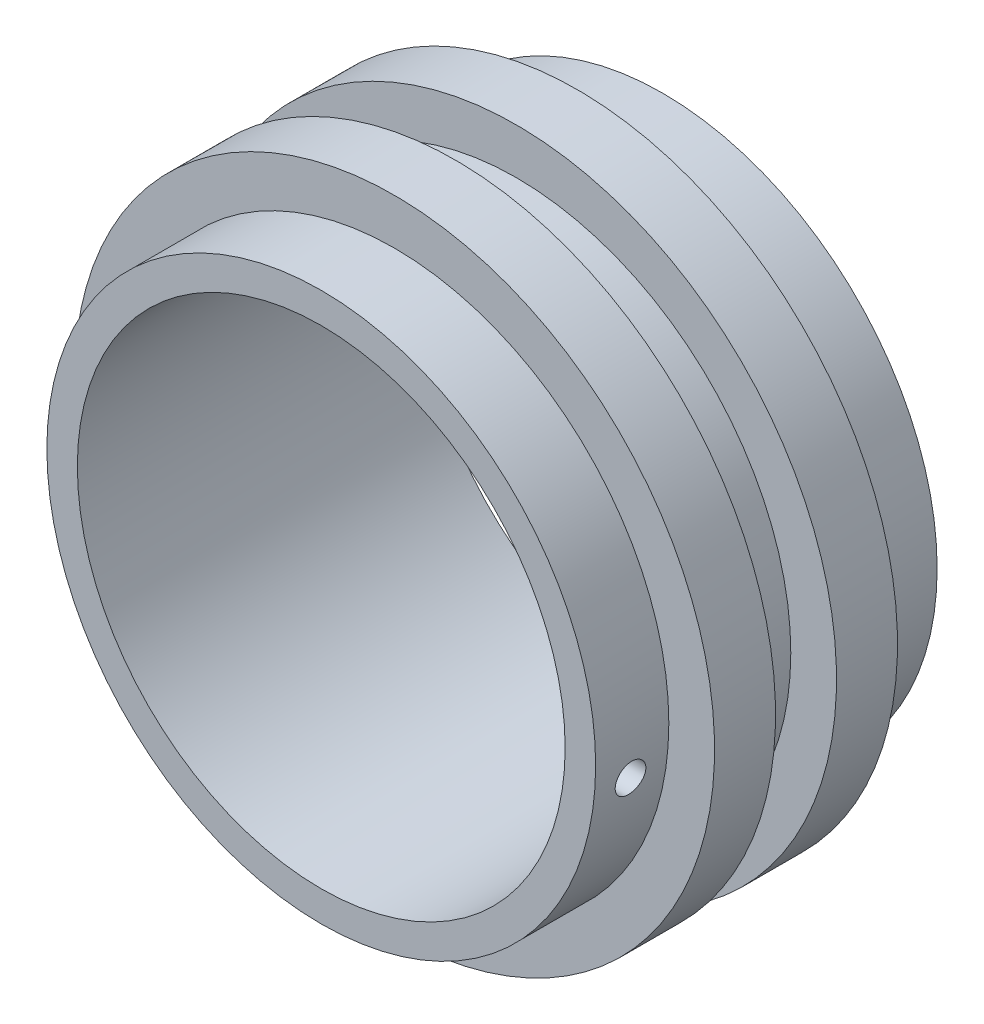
ISO-10303-21;
HEADER;
FILE_DESCRIPTION(('STEP AP214'),'2;1');
FILE_NAME('part.step','',(''),(''),'','','');
FILE_SCHEMA(('AUTOMOTIVE_DESIGN { 1 0 10303 214 1 1 1 1 }'));
ENDSEC;
DATA;
#1=APPLICATION_CONTEXT('core data for automotive mechanical design processes');
#2=APPLICATION_PROTOCOL_DEFINITION('international standard','automotive_design',2000,#1);
#3=PRODUCT_CONTEXT('',#1,'mechanical');
#4=PRODUCT('Part','Part','',(#3));
#5=PRODUCT_RELATED_PRODUCT_CATEGORY('part','',(#4));
#6=PRODUCT_DEFINITION_FORMATION('','',#4);
#7=PRODUCT_DEFINITION_CONTEXT('part definition',#1,'design');
#8=PRODUCT_DEFINITION('design','',#6,#7);
#9=PRODUCT_DEFINITION_SHAPE('','',#8);
#10=(LENGTH_UNIT() NAMED_UNIT(*) SI_UNIT(.MILLI.,.METRE.));
#11=(NAMED_UNIT(*) PLANE_ANGLE_UNIT() SI_UNIT($,.RADIAN.));
#12=(NAMED_UNIT(*) SI_UNIT($,.STERADIAN.) SOLID_ANGLE_UNIT());
#13=UNCERTAINTY_MEASURE_WITH_UNIT(LENGTH_MEASURE(1.E-05),#10,'distance_accuracy_value','');
#14=(GEOMETRIC_REPRESENTATION_CONTEXT(3) GLOBAL_UNCERTAINTY_ASSIGNED_CONTEXT((#13)) GLOBAL_UNIT_ASSIGNED_CONTEXT((#10,
#11,#12)) REPRESENTATION_CONTEXT('',''));
#15=CARTESIAN_POINT('',(0.,0.,0.));
#16=DIRECTION('',(0.,0.,1.));
#17=DIRECTION('',(1.,0.,0.));
#18=AXIS2_PLACEMENT_3D('',#15,#16,#17);
#19=CARTESIAN_POINT('',(0.,0.,152.4));
#20=DIRECTION('',(0.,0.,-1.));
#21=DIRECTION('',(-1.,0.,0.));
#22=AXIS2_PLACEMENT_3D('',#19,#20,#21);
#23=CYLINDRICAL_SURFACE('',#22,57.15);
#24=CARTESIAN_POINT('',(57.0682037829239,-3.05656948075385,36.8487640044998));
#25=CARTESIAN_POINT('',(57.0682041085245,-3.05657730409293,36.6706670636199));
#26=CARTESIAN_POINT('',(57.0674046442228,-3.07160482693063,36.4924446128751));
#27=CARTESIAN_POINT('',(57.0641575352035,-3.13133920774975,36.14091254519));
#28=CARTESIAN_POINT('',(57.0617079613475,-3.17608080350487,35.9676089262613));
#29=CARTESIAN_POINT('',(57.055024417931,-3.29395714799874,35.6310526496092));
#30=CARTESIAN_POINT('',(57.0507912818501,-3.36707863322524,35.4677953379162));
#31=CARTESIAN_POINT('',(57.0403469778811,-3.53959716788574,35.1559374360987));
#32=CARTESIAN_POINT('',(57.0341362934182,-3.63898779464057,35.0073332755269));
#33=CARTESIAN_POINT('',(57.0195217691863,-3.86121770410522,34.7289081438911));
#34=CARTESIAN_POINT('',(57.0111174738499,-3.98406185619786,34.5990910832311));
#35=CARTESIAN_POINT('',(56.9919347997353,-4.24965372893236,34.361932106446));
#36=CARTESIAN_POINT('',(56.9811563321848,-4.3924021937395,34.2545910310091));
#37=CARTESIAN_POINT('',(56.9571160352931,-4.693856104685,34.0652816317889));
#38=CARTESIAN_POINT('',(56.9438515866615,-4.85257829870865,33.9833403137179));
#39=CARTESIAN_POINT('',(56.9148820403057,-5.18130314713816,33.8472286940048));
#40=CARTESIAN_POINT('',(56.8991769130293,-5.35130593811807,33.7930587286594));
#41=CARTESIAN_POINT('',(56.8654706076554,-5.69835354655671,33.713784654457));
#42=CARTESIAN_POINT('',(56.8474617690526,-5.87542043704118,33.688780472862));
#43=CARTESIAN_POINT('',(56.809581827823,-6.23104233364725,33.6687726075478));
#44=CARTESIAN_POINT('',(56.7897106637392,-6.40959738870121,33.6737699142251));
#45=CARTESIAN_POINT('',(56.7485641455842,-6.76424618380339,33.7136550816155));
#46=CARTESIAN_POINT('',(56.7272812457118,-6.94031937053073,33.7487179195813));
#47=CARTESIAN_POINT('',(56.6841758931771,-7.28400450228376,33.8479308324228));
#48=CARTESIAN_POINT('',(56.6623534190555,-7.45161610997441,33.91208206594));
#49=CARTESIAN_POINT('',(56.6189581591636,-7.774494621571,34.0680612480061));
#50=CARTESIAN_POINT('',(56.5973871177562,-7.92969710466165,34.160023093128));
#51=CARTESIAN_POINT('',(56.5555993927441,-8.22244342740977,34.368968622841));
#52=CARTESIAN_POINT('',(56.5353827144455,-8.35998719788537,34.4859524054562));
#53=CARTESIAN_POINT('',(56.4973519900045,-8.61325306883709,34.7415100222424));
#54=CARTESIAN_POINT('',(56.4795342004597,-8.72900928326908,34.8800494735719));
#55=CARTESIAN_POINT('',(56.4472271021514,-8.93554793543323,35.1749865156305));
#56=CARTESIAN_POINT('',(56.432737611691,-9.02633173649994,35.3313831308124));
#57=CARTESIAN_POINT('',(56.4080387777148,-9.17941416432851,35.6559846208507));
#58=CARTESIAN_POINT('',(56.397789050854,-9.24198208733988,35.8240593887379));
#59=CARTESIAN_POINT('',(56.3819716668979,-9.33799564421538,36.1685394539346));
#60=CARTESIAN_POINT('',(56.3764036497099,-9.37144351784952,36.34494410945));
#61=CARTESIAN_POINT('',(56.3703218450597,-9.40795716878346,36.6988698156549));
#62=CARTESIAN_POINT('',(56.3697498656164,-9.41137275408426,36.8763538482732));
#63=CARTESIAN_POINT('',(56.3735416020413,-9.38863333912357,37.2293591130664));
#64=CARTESIAN_POINT('',(56.3779051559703,-9.36247930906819,37.4048804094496));
#65=CARTESIAN_POINT('',(56.3912813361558,-9.2815700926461,37.7482734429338));
#66=CARTESIAN_POINT('',(56.4002755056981,-9.22692844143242,37.9161726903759));
#67=CARTESIAN_POINT('',(56.4223844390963,-9.090751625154,38.2403893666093));
#68=CARTESIAN_POINT('',(56.4354993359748,-9.00921559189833,38.3967064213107));
#69=CARTESIAN_POINT('',(56.4652306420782,-8.82096024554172,38.6945535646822));
#70=CARTESIAN_POINT('',(56.4818712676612,-8.71406612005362,38.8359707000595));
#71=CARTESIAN_POINT('',(56.5177150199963,-8.47847583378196,39.0989205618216));
#72=CARTESIAN_POINT('',(56.5369183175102,-8.34977821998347,39.2204519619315));
#73=CARTESIAN_POINT('',(56.5771776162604,-8.07250246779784,39.4417211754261));
#74=CARTESIAN_POINT('',(56.5982531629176,-7.92370335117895,39.5411785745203));
#75=CARTESIAN_POINT('',(56.6410689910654,-7.61160862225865,39.7137096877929));
#76=CARTESIAN_POINT('',(56.6628093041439,-7.44831232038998,39.7867821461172));
#77=CARTESIAN_POINT('',(56.7062019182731,-7.11044091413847,39.9049849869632));
#78=CARTESIAN_POINT('',(56.7278522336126,-6.93578825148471,39.9498945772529));
#79=CARTESIAN_POINT('',(56.7700727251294,-6.58127615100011,40.0095613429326));
#80=CARTESIAN_POINT('',(56.7906428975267,-6.40141669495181,40.0243184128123));
#81=CARTESIAN_POINT('',(56.8300359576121,-6.04170737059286,40.0231780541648));
#82=CARTESIAN_POINT('',(56.848859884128,-5.86185756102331,40.0072989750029));
#83=CARTESIAN_POINT('',(56.8843095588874,-5.50723072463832,39.9452712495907));
#84=CARTESIAN_POINT('',(56.9009353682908,-5.33245355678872,39.8991234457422));
#85=CARTESIAN_POINT('',(56.9316345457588,-4.99401860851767,39.7781333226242));
#86=CARTESIAN_POINT('',(56.9457218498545,-4.83030340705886,39.7034551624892));
#87=CARTESIAN_POINT('',(56.9713764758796,-4.51767546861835,39.527451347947));
#88=CARTESIAN_POINT('',(56.9829439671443,-4.36876173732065,39.4261274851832));
#89=CARTESIAN_POINT('',(57.0035689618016,-4.09084052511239,39.2003146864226));
#90=CARTESIAN_POINT('',(57.0126398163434,-3.96172886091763,39.075955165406));
#91=CARTESIAN_POINT('',(57.02852165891,-3.72615052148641,38.8071905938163));
#92=CARTESIAN_POINT('',(57.0353321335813,-3.61968899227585,38.6627810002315));
#93=CARTESIAN_POINT('',(57.0468893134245,-3.43273964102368,38.3584067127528));
#94=CARTESIAN_POINT('',(57.0516404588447,-3.35219603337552,38.1984764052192));
#95=CARTESIAN_POINT('',(57.0593026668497,-3.21915535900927,37.8674559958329));
#96=CARTESIAN_POINT('',(57.0622158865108,-3.16662542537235,37.6963792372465));
#97=CARTESIAN_POINT('',(57.0656039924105,-3.10481524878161,37.4116702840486));
#98=CARTESIAN_POINT('',(57.0665808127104,-3.0867462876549,37.2998746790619));
#99=CARTESIAN_POINT('',(57.0678806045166,-3.06262091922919,37.0749909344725));
#100=CARTESIAN_POINT('',(57.0682035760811,-3.05656451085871,36.9619027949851));
#101=CARTESIAN_POINT('',(57.0682037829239,-3.05656948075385,36.8487640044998));
#102=B_SPLINE_CURVE_WITH_KNOTS('',3,(#24,#25,#26,#27,#28,#29,#30,#31,#32,#33,#34,#35,#36,#37,
#38,#39,#40,#41,#42,#43,#44,#45,#46,#47,#48,#49,#50,#51,#52,#53,#54,#55,#56,#57,#58,#59,#60,#61,
#62,#63,#64,#65,#66,#67,#68,#69,#70,#71,#72,#73,#74,#75,#76,#77,#78,#79,#80,#81,#82,#83,#84,#85,
#86,#87,#88,#89,#90,#91,#92,#93,#94,#95,#96,#97,#98,#99,#100,#101),.UNSPECIFIED.,.T.,.F.,(4,2,2,
2,2,2,2,2,2,2,2,2,2,2,2,2,2,2,2,2,2,2,2,2,2,2,2,2,2,2,2,2,2,2,2,2,2,2,4),(0.,0.533878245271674,
1.06838173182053,1.60263571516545,2.13675919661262,2.67099369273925,3.20524816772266,
3.74006874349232,4.27489579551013,4.81154992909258,5.34822177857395,5.88803834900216,
6.42787642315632,6.97035613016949,7.51283796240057,8.05446320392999,8.59605887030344,
9.13237000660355,9.66863988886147,10.198655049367,10.7286528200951,11.2565542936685,
11.7844728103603,12.3161422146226,12.8478470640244,13.3859622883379,13.9241031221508,
14.4664118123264,15.0087224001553,15.550708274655,16.0926790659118,16.6315772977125,
17.1704393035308,17.7063610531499,18.2424044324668,18.777286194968,19.3115390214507,
19.6506933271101,19.989847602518),.UNSPECIFIED.);
#103=CARTESIAN_POINT('',(57.0682037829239,-3.05656948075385,36.8487640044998));
#104=VERTEX_POINT('',#103);
#105=EDGE_CURVE('E96',#104,#104,#102,.T.);
#106=ORIENTED_EDGE('',*,*,#105,.T.);
#107=EDGE_LOOP('',(#106));
#108=FACE_BOUND('',#107,.T.);
#109=CARTESIAN_POINT('',(0.,0.,43.18));
#110=DIRECTION('',(0.,0.,-1.));
#111=DIRECTION('',(-1.,0.,0.));
#112=AXIS2_PLACEMENT_3D('',#109,#110,#111);
#113=CIRCLE('',#112,57.15);
#114=CARTESIAN_POINT('',(-57.15,0.,43.18));
#115=VERTEX_POINT('',#114);
#116=EDGE_CURVE('E112',#115,#115,#113,.T.);
#117=ORIENTED_EDGE('',*,*,#116,.T.);
#118=EDGE_LOOP('',(#117));
#119=FACE_BOUND('',#118,.T.);
#120=CARTESIAN_POINT('',(0.,0.,30.48));
#121=DIRECTION('',(0.,0.,-1.));
#122=DIRECTION('',(-1.,0.,0.));
#123=AXIS2_PLACEMENT_3D('',#120,#121,#122);
#124=CIRCLE('',#123,57.15);
#125=CARTESIAN_POINT('',(-57.15,0.,30.48));
#126=VERTEX_POINT('',#125);
#127=EDGE_CURVE('E10',#126,#126,#124,.T.);
#128=ORIENTED_EDGE('',*,*,#127,.F.);
#129=EDGE_LOOP('',(#128));
#130=FACE_BOUND('',#129,.T.);
#131=ADVANCED_FACE('F39',(#108,#119,#130),#23,.T.);
#132=CARTESIAN_POINT('',(57.0682037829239,-3.05656948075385,63.5187640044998));
#133=CARTESIAN_POINT('',(57.0682041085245,-3.05657730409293,63.3406670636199));
#134=CARTESIAN_POINT('',(57.0674046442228,-3.07160482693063,63.1624446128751));
#135=CARTESIAN_POINT('',(57.0641575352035,-3.13133920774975,62.8109125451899));
#136=CARTESIAN_POINT('',(57.0617079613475,-3.17608080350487,62.6376089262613));
#137=CARTESIAN_POINT('',(57.055024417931,-3.29395714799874,62.3010526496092));
#138=CARTESIAN_POINT('',(57.0507912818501,-3.36707863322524,62.1377953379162));
#139=CARTESIAN_POINT('',(57.0403469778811,-3.53959716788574,61.8259374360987));
#140=CARTESIAN_POINT('',(57.0341362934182,-3.63898779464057,61.6773332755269));
#141=CARTESIAN_POINT('',(57.0195217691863,-3.86121770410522,61.3989081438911));
#142=CARTESIAN_POINT('',(57.0111174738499,-3.98406185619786,61.2690910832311));
#143=CARTESIAN_POINT('',(56.9919347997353,-4.24965372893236,61.031932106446));
#144=CARTESIAN_POINT('',(56.9811563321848,-4.3924021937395,60.9245910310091));
#145=CARTESIAN_POINT('',(56.9571160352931,-4.693856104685,60.7352816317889));
#146=CARTESIAN_POINT('',(56.9438515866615,-4.85257829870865,60.6533403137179));
#147=CARTESIAN_POINT('',(56.9148820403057,-5.18130314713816,60.5172286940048));
#148=CARTESIAN_POINT('',(56.8991769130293,-5.35130593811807,60.4630587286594));
#149=CARTESIAN_POINT('',(56.8654706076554,-5.69835354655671,60.383784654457));
#150=CARTESIAN_POINT('',(56.8474617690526,-5.87542043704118,60.358780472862));
#151=CARTESIAN_POINT('',(56.809581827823,-6.23104233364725,60.3387726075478));
#152=CARTESIAN_POINT('',(56.7897106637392,-6.40959738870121,60.3437699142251));
#153=CARTESIAN_POINT('',(56.7485641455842,-6.76424618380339,60.3836550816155));
#154=CARTESIAN_POINT('',(56.7272812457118,-6.94031937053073,60.4187179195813));
#155=CARTESIAN_POINT('',(56.6841758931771,-7.28400450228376,60.5179308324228));
#156=CARTESIAN_POINT('',(56.6623534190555,-7.45161610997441,60.58208206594));
#157=CARTESIAN_POINT('',(56.6189581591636,-7.774494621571,60.7380612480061));
#158=CARTESIAN_POINT('',(56.5973871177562,-7.92969710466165,60.830023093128));
#159=CARTESIAN_POINT('',(56.5555993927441,-8.22244342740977,61.038968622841));
#160=CARTESIAN_POINT('',(56.5353827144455,-8.35998719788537,61.1559524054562));
#161=CARTESIAN_POINT('',(56.4973519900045,-8.61325306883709,61.4115100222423));
#162=CARTESIAN_POINT('',(56.4795342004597,-8.72900928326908,61.5500494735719));
#163=CARTESIAN_POINT('',(56.4472271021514,-8.93554793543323,61.8449865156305));
#164=CARTESIAN_POINT('',(56.432737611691,-9.02633173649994,62.0013831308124));
#165=CARTESIAN_POINT('',(56.4080387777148,-9.17941416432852,62.3259846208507));
#166=CARTESIAN_POINT('',(56.397789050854,-9.24198208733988,62.4940593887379));
#167=CARTESIAN_POINT('',(56.3819716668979,-9.33799564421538,62.8385394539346));
#168=CARTESIAN_POINT('',(56.3764036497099,-9.37144351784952,63.01494410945));
#169=CARTESIAN_POINT('',(56.3703218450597,-9.40795716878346,63.3688698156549));
#170=CARTESIAN_POINT('',(56.3697498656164,-9.41137275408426,63.5463538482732));
#171=CARTESIAN_POINT('',(56.3735416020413,-9.38863333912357,63.8993591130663));
#172=CARTESIAN_POINT('',(56.3779051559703,-9.36247930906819,64.0748804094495));
#173=CARTESIAN_POINT('',(56.3912813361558,-9.2815700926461,64.4182734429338));
#174=CARTESIAN_POINT('',(56.4002755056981,-9.22692844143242,64.5861726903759));
#175=CARTESIAN_POINT('',(56.4223844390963,-9.090751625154,64.9103893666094));
#176=CARTESIAN_POINT('',(56.4354993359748,-9.00921559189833,65.0667064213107));
#177=CARTESIAN_POINT('',(56.4652306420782,-8.82096024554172,65.3645535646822));
#178=CARTESIAN_POINT('',(56.4818712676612,-8.71406612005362,65.5059707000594));
#179=CARTESIAN_POINT('',(56.5177150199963,-8.47847583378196,65.7689205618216));
#180=CARTESIAN_POINT('',(56.5369183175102,-8.34977821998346,65.8904519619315));
#181=CARTESIAN_POINT('',(56.5771776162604,-8.07250246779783,66.1117211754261));
#182=CARTESIAN_POINT('',(56.5982531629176,-7.92370335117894,66.2111785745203));
#183=CARTESIAN_POINT('',(56.6410689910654,-7.61160862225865,66.3837096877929));
#184=CARTESIAN_POINT('',(56.6628093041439,-7.44831232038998,66.4567821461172));
#185=CARTESIAN_POINT('',(56.7062019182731,-7.11044091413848,66.5749849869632));
#186=CARTESIAN_POINT('',(56.7278522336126,-6.93578825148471,66.6198945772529));
#187=CARTESIAN_POINT('',(56.7700727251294,-6.58127615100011,66.6795613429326));
#188=CARTESIAN_POINT('',(56.7906428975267,-6.40141669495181,66.6943184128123));
#189=CARTESIAN_POINT('',(56.8300359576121,-6.04170737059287,66.6931780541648));
#190=CARTESIAN_POINT('',(56.848859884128,-5.86185756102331,66.6772989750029));
#191=CARTESIAN_POINT('',(56.8843095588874,-5.50723072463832,66.6152712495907));
#192=CARTESIAN_POINT('',(56.9009353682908,-5.33245355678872,66.5691234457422));
#193=CARTESIAN_POINT('',(56.9316345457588,-4.99401860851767,66.4481333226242));
#194=CARTESIAN_POINT('',(56.9457218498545,-4.83030340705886,66.3734551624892));
#195=CARTESIAN_POINT('',(56.9713764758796,-4.51767546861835,66.197451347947));
#196=CARTESIAN_POINT('',(56.9829439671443,-4.36876173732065,66.0961274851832));
#197=CARTESIAN_POINT('',(57.0035689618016,-4.09084052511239,65.8703146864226));
#198=CARTESIAN_POINT('',(57.0126398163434,-3.96172886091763,65.7459551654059));
#199=CARTESIAN_POINT('',(57.02852165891,-3.7261505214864,65.4771905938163));
#200=CARTESIAN_POINT('',(57.0353321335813,-3.61968899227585,65.3327810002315));
#201=CARTESIAN_POINT('',(57.0468893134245,-3.43273964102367,65.0284067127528));
#202=CARTESIAN_POINT('',(57.0516404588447,-3.35219603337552,64.8684764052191));
#203=CARTESIAN_POINT('',(57.0593026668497,-3.21915535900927,64.5374559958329));
#204=CARTESIAN_POINT('',(57.0622158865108,-3.16662542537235,64.3663792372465));
#205=CARTESIAN_POINT('',(57.0656039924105,-3.10481524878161,64.0816702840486));
#206=CARTESIAN_POINT('',(57.0665808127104,-3.0867462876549,63.969874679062));
#207=CARTESIAN_POINT('',(57.0678806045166,-3.06262091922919,63.7449909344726));
#208=CARTESIAN_POINT('',(57.0682035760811,-3.05656451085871,63.6319027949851));
#209=CARTESIAN_POINT('',(57.0682037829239,-3.05656948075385,63.5187640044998));
#210=B_SPLINE_CURVE_WITH_KNOTS('',3,(#132,#133,#134,#135,#136,#137,#138,#139,#140,#141,#142,
#143,#144,#145,#146,#147,#148,#149,#150,#151,#152,#153,#154,#155,#156,#157,#158,#159,#160,#161,
#162,#163,#164,#165,#166,#167,#168,#169,#170,#171,#172,#173,#174,#175,#176,#177,#178,#179,#180,
#181,#182,#183,#184,#185,#186,#187,#188,#189,#190,#191,#192,#193,#194,#195,#196,#197,#198,#199,
#200,#201,#202,#203,#204,#205,#206,#207,#208,#209),.UNSPECIFIED.,.T.,.F.,(4,2,2,2,2,2,2,2,2,2,2,
2,2,2,2,2,2,2,2,2,2,2,2,2,2,2,2,2,2,2,2,2,2,2,2,2,2,2,4),(0.,0.533878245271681,1.06838173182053,
1.60263571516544,2.13675919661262,2.67099369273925,3.20524816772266,3.74006874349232,
4.27489579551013,4.81154992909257,5.34822177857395,5.88803834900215,6.42787642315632,
6.97035613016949,7.51283796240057,8.05446320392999,8.59605887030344,9.13237000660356,
9.66863988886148,10.198655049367,10.7286528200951,11.2565542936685,11.7844728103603,
12.3161422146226,12.8478470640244,13.3859622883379,13.9241031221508,14.4664118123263,
15.0087224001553,15.550708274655,16.0926790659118,16.6315772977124,17.1704393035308,
17.7063610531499,18.2424044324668,18.7772861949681,19.3115390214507,19.6506933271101,
19.989847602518),.UNSPECIFIED.);
#211=CARTESIAN_POINT('',(57.0682037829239,-3.05656948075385,63.5187640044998));
#212=VERTEX_POINT('',#211);
#213=EDGE_CURVE('E70',#212,#212,#210,.T.);
#214=ORIENTED_EDGE('',*,*,#213,.T.);
#215=EDGE_LOOP('',(#214));
#216=FACE_BOUND('',#215,.T.);
#217=CARTESIAN_POINT('',(0.,0.,71.12));
#218=DIRECTION('',(0.,0.,-1.));
#219=DIRECTION('',(0.,1.,0.));
#220=AXIS2_PLACEMENT_3D('',#217,#218,#219);
#221=CIRCLE('',#220,57.15);
#222=CARTESIAN_POINT('',(0.,57.15,71.12));
#223=VERTEX_POINT('',#222);
#224=EDGE_CURVE('E71',#223,#223,#221,.T.);
#225=ORIENTED_EDGE('',*,*,#224,.T.);
#226=EDGE_LOOP('',(#225));
#227=FACE_BOUND('',#226,.T.);
#228=CARTESIAN_POINT('',(0.,0.,55.88));
#229=DIRECTION('',(0.,0.,-1.));
#230=DIRECTION('',(-1.,0.,0.));
#231=AXIS2_PLACEMENT_3D('',#228,#229,#230);
#232=CIRCLE('',#231,57.15);
#233=CARTESIAN_POINT('',(-57.15,0.,55.88));
#234=VERTEX_POINT('',#233);
#235=EDGE_CURVE('E54',#234,#234,#232,.T.);
#236=ORIENTED_EDGE('',*,*,#235,.F.);
#237=EDGE_LOOP('',(#236));
#238=FACE_BOUND('',#237,.T.);
#239=ADVANCED_FACE('F144',(#216,#227,#238),#23,.T.);
#240=CARTESIAN_POINT('',(0.,0.,17.78));
#241=DIRECTION('',(0.,0.,-1.));
#242=DIRECTION('',(-1.,0.,0.));
#243=AXIS2_PLACEMENT_3D('',#240,#241,#242);
#244=CIRCLE('',#243,57.15);
#245=CARTESIAN_POINT('',(-57.15,0.,17.78));
#246=VERTEX_POINT('',#245);
#247=EDGE_CURVE('E103',#246,#246,#244,.T.);
#248=CARTESIAN_POINT('',(0.,0.,0.));
#249=DIRECTION('',(0.,0.,1.));
#250=DIRECTION('',(1.,0.,0.));
#251=AXIS2_PLACEMENT_3D('',#248,#249,#250);
#252=CIRCLE('',#251,57.15);
#253=CARTESIAN_POINT('',(-57.15,0.,0.));
#254=VERTEX_POINT('',#253);
#255=EDGE_CURVE('E60',#254,#254,#252,.T.);
#256=CARTESIAN_POINT('',(-57.15,0.,17.78));
#257=CARTESIAN_POINT('',(-57.15,0.,17.5947916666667));
#258=CARTESIAN_POINT('',(-57.15,0.,17.4095833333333));
#259=CARTESIAN_POINT('',(-57.15,0.,17.0391666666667));
#260=CARTESIAN_POINT('',(-57.15,0.,16.8539583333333));
#261=CARTESIAN_POINT('',(-57.15,0.,16.4835416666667));
#262=CARTESIAN_POINT('',(-57.15,0.,16.2983333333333));
#263=CARTESIAN_POINT('',(-57.15,0.,15.9279166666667));
#264=CARTESIAN_POINT('',(-57.15,0.,15.7427083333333));
#265=CARTESIAN_POINT('',(-57.15,0.,15.3722916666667));
#266=CARTESIAN_POINT('',(-57.15,0.,15.1870833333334));
#267=CARTESIAN_POINT('',(-57.15,0.,14.8166666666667));
#268=CARTESIAN_POINT('',(-57.15,0.,14.6314583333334));
#269=CARTESIAN_POINT('',(-57.15,0.,14.2610416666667));
#270=CARTESIAN_POINT('',(-57.15,0.,14.0758333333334));
#271=CARTESIAN_POINT('',(-57.15,0.,13.7054166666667));
#272=CARTESIAN_POINT('',(-57.15,0.,13.5202083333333));
#273=CARTESIAN_POINT('',(-57.15,0.,13.1497916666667));
#274=CARTESIAN_POINT('',(-57.15,0.,12.9645833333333));
#275=CARTESIAN_POINT('',(-57.15,0.,12.5941666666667));
#276=CARTESIAN_POINT('',(-57.15,0.,12.4089583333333));
#277=CARTESIAN_POINT('',(-57.15,0.,12.0385416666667));
#278=CARTESIAN_POINT('',(-57.15,0.,11.8533333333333));
#279=CARTESIAN_POINT('',(-57.15,0.,11.4829166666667));
#280=CARTESIAN_POINT('',(-57.15,0.,11.2977083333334));
#281=CARTESIAN_POINT('',(-57.15,0.,10.9272916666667));
#282=CARTESIAN_POINT('',(-57.15,0.,10.7420833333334));
#283=CARTESIAN_POINT('',(-57.15,0.,10.3716666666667));
#284=CARTESIAN_POINT('',(-57.15,0.,10.1864583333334));
#285=CARTESIAN_POINT('',(-57.15,0.,9.81604166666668));
#286=CARTESIAN_POINT('',(-57.15,0.,9.63083333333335));
#287=CARTESIAN_POINT('',(-57.15,0.,9.26041666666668));
#288=CARTESIAN_POINT('',(-57.15,0.,9.07520833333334));
#289=CARTESIAN_POINT('',(-57.15,0.,8.70479166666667));
#290=CARTESIAN_POINT('',(-57.15,0.,8.51958333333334));
#291=CARTESIAN_POINT('',(-57.15,0.,8.14916666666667));
#292=CARTESIAN_POINT('',(-57.15,0.,7.96395833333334));
#293=CARTESIAN_POINT('',(-57.15,0.,7.59354166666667));
#294=CARTESIAN_POINT('',(-57.15,0.,7.40833333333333));
#295=CARTESIAN_POINT('',(-57.15,0.,7.03791666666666));
#296=CARTESIAN_POINT('',(-57.15,0.,6.85270833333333));
#297=CARTESIAN_POINT('',(-57.15,0.,6.48229166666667));
#298=CARTESIAN_POINT('',(-57.15,0.,6.29708333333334));
#299=CARTESIAN_POINT('',(-57.15,0.,5.92666666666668));
#300=CARTESIAN_POINT('',(-57.15,0.,5.74145833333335));
#301=CARTESIAN_POINT('',(-57.15,0.,5.37104166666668));
#302=CARTESIAN_POINT('',(-57.15,0.,5.18583333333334));
#303=CARTESIAN_POINT('',(-57.15,0.,4.81541666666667));
#304=CARTESIAN_POINT('',(-57.15,0.,4.63020833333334));
#305=CARTESIAN_POINT('',(-57.15,0.,4.25979166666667));
#306=CARTESIAN_POINT('',(-57.15,0.,4.07458333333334));
#307=CARTESIAN_POINT('',(-57.15,0.,3.70416666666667));
#308=CARTESIAN_POINT('',(-57.15,0.,3.51895833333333));
#309=CARTESIAN_POINT('',(-57.15,0.,3.14854166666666));
#310=CARTESIAN_POINT('',(-57.15,0.,2.96333333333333));
#311=CARTESIAN_POINT('',(-57.15,0.,2.59291666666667));
#312=CARTESIAN_POINT('',(-57.15,0.,2.40770833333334));
#313=CARTESIAN_POINT('',(-57.15,0.,2.03729166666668));
#314=CARTESIAN_POINT('',(-57.15,0.,1.85208333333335));
#315=CARTESIAN_POINT('',(-57.15,0.,1.48166666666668));
#316=CARTESIAN_POINT('',(-57.15,0.,1.29645833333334));
#317=CARTESIAN_POINT('',(-57.15,0.,0.926041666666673));
#318=CARTESIAN_POINT('',(-57.15,0.,0.740833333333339));
#319=CARTESIAN_POINT('',(-57.15,0.,0.370416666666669));
#320=CARTESIAN_POINT('',(-57.15,0.,0.185208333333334));
#321=CARTESIAN_POINT('',(-57.15,0.,0.));
#322=B_SPLINE_CURVE_WITH_KNOTS('',3,(#256,#257,#258,#259,#260,#261,#262,#263,#264,#265,#266,
#267,#268,#269,#270,#271,#272,#273,#274,#275,#276,#277,#278,#279,#280,#281,#282,#283,#284,#285,
#286,#287,#288,#289,#290,#291,#292,#293,#294,#295,#296,#297,#298,#299,#300,#301,#302,#303,#304,
#305,#306,#307,#308,#309,#310,#311,#312,#313,#314,#315,#316,#317,#318,#319,#320,#321),
.UNSPECIFIED.,.F.,.F.,(4,2,2,2,2,2,2,2,2,2,2,2,2,2,2,2,2,2,2,2,2,2,2,2,2,2,2,2,2,2,2,2,4),(0.,
0.555625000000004,1.11125000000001,1.66687500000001,2.22250000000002,2.77812499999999,3.33375,
3.889375,4.445,5.00062500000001,5.55625000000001,6.11187500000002,6.66749999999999,7.223125,
7.77875,8.334375,8.89000000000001,9.44562500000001,10.00125,10.556875,11.1125,11.668125,
12.22375,12.779375,13.335,13.890625,14.44625,15.001875,15.5575,16.113125,16.66875,17.224375,
17.78),.UNSPECIFIED.);
#323=EDGE_CURVE('BSEAM41',#246,#254,#322,.T.);
#324=ORIENTED_EDGE('',*,*,#247,.T.);
#325=ORIENTED_EDGE('',*,*,#255,.T.);
#326=ORIENTED_EDGE('',*,*,#323,.T.);
#327=ORIENTED_EDGE('',*,*,#323,.F.);
#328=EDGE_LOOP('',(#324,#326,#325,#327));
#329=FACE_BOUND('',#328,.T.);
#330=ADVANCED_FACE('F41',(#329),#23,.T.);
#331=CARTESIAN_POINT('',(0.,0.,0.));
#332=DIRECTION('',(0.,0.,1.));
#333=DIRECTION('',(1.,0.,0.));
#334=AXIS2_PLACEMENT_3D('',#331,#332,#333);
#335=PLANE('',#334);
#336=CARTESIAN_POINT('',(0.,0.,0.));
#337=DIRECTION('',(0.,0.,1.));
#338=DIRECTION('',(1.,0.,0.));
#339=AXIS2_PLACEMENT_3D('',#336,#337,#338);
#340=CIRCLE('',#339,50.8);
#341=CARTESIAN_POINT('',(50.8,0.,0.));
#342=VERTEX_POINT('',#341);
#343=EDGE_CURVE('E124',#342,#342,#340,.T.);
#344=ORIENTED_EDGE('',*,*,#343,.T.);
#345=EDGE_LOOP('',(#344));
#346=FACE_BOUND('',#345,.T.);
#347=ORIENTED_EDGE('',*,*,#255,.F.);
#348=EDGE_LOOP('',(#347));
#349=FACE_BOUND('',#348,.T.);
#350=ADVANCED_FACE('F135',(#346,#349),#335,.F.);
#351=CARTESIAN_POINT('',(0.,0.,0.));
#352=DIRECTION('',(0.,0.,1.));
#353=DIRECTION('',(1.,0.,0.));
#354=AXIS2_PLACEMENT_3D('',#351,#352,#353);
#355=CYLINDRICAL_SURFACE('',#354,50.8);
#356=CARTESIAN_POINT('',(0.,0.,71.12));
#357=DIRECTION('',(0.,0.,-1.));
#358=DIRECTION('',(0.,1.,0.));
#359=AXIS2_PLACEMENT_3D('',#356,#357,#358);
#360=CIRCLE('',#359,50.8);
#361=CARTESIAN_POINT('',(0.,50.8,71.12));
#362=VERTEX_POINT('',#361);
#363=EDGE_CURVE('E274',#362,#362,#360,.F.);
#364=ORIENTED_EDGE('',*,*,#363,.T.);
#365=EDGE_LOOP('',(#364));
#366=FACE_BOUND('',#365,.T.);
#367=CARTESIAN_POINT('',(50.7079617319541,-3.05656948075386,36.8487640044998));
#368=CARTESIAN_POINT('',(50.7079620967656,-3.05657728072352,37.0267959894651));
#369=CARTESIAN_POINT('',(50.7070630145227,-3.07159384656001,37.2049524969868));
#370=CARTESIAN_POINT('',(50.7034113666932,-3.13128338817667,37.5563533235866));
#371=CARTESIAN_POINT('',(50.7006566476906,-3.17599081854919,37.7295916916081));
#372=CARTESIAN_POINT('',(50.6931407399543,-3.29377357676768,38.0660214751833));
#373=CARTESIAN_POINT('',(50.6883804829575,-3.36683573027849,38.2292175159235));
#374=CARTESIAN_POINT('',(50.6766361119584,-3.53920588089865,38.5409590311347));
#375=CARTESIAN_POINT('',(50.6696525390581,-3.63850749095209,38.6895080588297));
#376=CARTESIAN_POINT('',(50.6532200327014,-3.8605253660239,38.9678369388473));
#377=CARTESIAN_POINT('',(50.6437705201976,-3.98324712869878,39.0976123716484));
#378=CARTESIAN_POINT('',(50.6222037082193,-4.24854876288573,39.3347055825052));
#379=CARTESIAN_POINT('',(50.6100863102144,-4.39112936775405,39.4420225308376));
#380=CARTESIAN_POINT('',(50.5830580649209,-4.69223627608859,39.6313433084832));
#381=CARTESIAN_POINT('',(50.5681434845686,-4.85078375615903,39.7133129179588));
#382=CARTESIAN_POINT('',(50.535571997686,-5.17910735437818,39.8495202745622));
#383=CARTESIAN_POINT('',(50.5179150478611,-5.34888364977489,39.9037575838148));
#384=CARTESIAN_POINT('',(50.4800041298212,-5.69558655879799,39.9832679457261));
#385=CARTESIAN_POINT('',(50.4597392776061,-5.87254088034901,40.0084149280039));
#386=CARTESIAN_POINT('',(50.4171117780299,-6.22791039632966,40.0287469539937));
#387=CARTESIAN_POINT('',(50.3947490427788,-6.40632565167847,40.0239307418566));
#388=CARTESIAN_POINT('',(50.3484015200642,-6.76096778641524,39.9844346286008));
#389=CARTESIAN_POINT('',(50.324405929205,-6.93716860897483,39.9495334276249));
#390=CARTESIAN_POINT('',(50.2757952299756,-7.28111281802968,39.8506149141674));
#391=CARTESIAN_POINT('',(50.2511800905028,-7.44885577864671,39.7865961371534));
#392=CARTESIAN_POINT('',(50.2021837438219,-7.77223799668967,39.630738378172));
#393=CARTESIAN_POINT('',(50.1778049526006,-7.92779525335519,39.5387284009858));
#394=CARTESIAN_POINT('',(50.1305639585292,-8.22123339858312,39.3295555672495));
#395=CARTESIAN_POINT('',(50.1077017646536,-8.35911418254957,39.2123925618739));
#396=CARTESIAN_POINT('',(50.064692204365,-8.61296543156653,38.9563717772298));
#397=CARTESIAN_POINT('',(50.0445396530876,-8.72897791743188,38.8175565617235));
#398=CARTESIAN_POINT('',(50.0079965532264,-8.93595906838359,38.521921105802));
#399=CARTESIAN_POINT('',(49.9916057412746,-9.0269294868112,38.3651021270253));
#400=CARTESIAN_POINT('',(49.9637125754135,-9.18005654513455,38.0399571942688));
#401=CARTESIAN_POINT('',(49.9521522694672,-9.24255563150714,37.8717975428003));
#402=CARTESIAN_POINT('',(49.9343214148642,-9.33841245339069,37.5271025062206));
#403=CARTESIAN_POINT('',(49.9280503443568,-9.37177306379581,37.3505679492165));
#404=CARTESIAN_POINT('',(49.9212342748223,-9.40801290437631,36.9969427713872));
#405=CARTESIAN_POINT('',(49.9206057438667,-9.41133680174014,36.8198992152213));
#406=CARTESIAN_POINT('',(49.924893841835,-9.38856246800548,36.4677888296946));
#407=CARTESIAN_POINT('',(49.9298102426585,-9.36246544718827,36.2927219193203));
#408=CARTESIAN_POINT('',(49.9448536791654,-9.28187703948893,35.950425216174));
#409=CARTESIAN_POINT('',(49.9549544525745,-9.22752874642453,35.7831605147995));
#410=CARTESIAN_POINT('',(49.9797661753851,-9.09217684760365,35.4601614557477));
#411=CARTESIAN_POINT('',(49.9944773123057,-9.01117215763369,35.3044275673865));
#412=CARTESIAN_POINT('',(50.027845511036,-8.82404404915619,35.0073525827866));
#413=CARTESIAN_POINT('',(50.0465369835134,-8.71770055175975,34.866154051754));
#414=CARTESIAN_POINT('',(50.0867930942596,-8.48335196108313,34.6035287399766));
#415=CARTESIAN_POINT('',(50.1083579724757,-8.35534505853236,34.4821036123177));
#416=CARTESIAN_POINT('',(50.1536409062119,-8.07911824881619,34.260518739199));
#417=CARTESIAN_POINT('',(50.1773868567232,-7.93061905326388,34.1607127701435));
#418=CARTESIAN_POINT('',(50.2256342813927,-7.61908661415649,33.9874363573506));
#419=CARTESIAN_POINT('',(50.250135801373,-7.45605248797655,33.9139675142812));
#420=CARTESIAN_POINT('',(50.2991006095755,-7.11827629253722,33.7947892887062));
#421=CARTESIAN_POINT('',(50.3235611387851,-6.94343463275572,33.7493607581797));
#422=CARTESIAN_POINT('',(50.3712693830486,-6.58842060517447,33.6887467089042));
#423=CARTESIAN_POINT('',(50.3945170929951,-6.40824821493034,33.6735613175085));
#424=CARTESIAN_POINT('',(50.4390406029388,-6.04782028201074,33.6739706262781));
#425=CARTESIAN_POINT('',(50.4603178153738,-5.86756489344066,33.6895430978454));
#426=CARTESIAN_POINT('',(50.5003902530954,-5.51204082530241,33.7511122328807));
#427=CARTESIAN_POINT('',(50.5191855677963,-5.33677196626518,33.7971077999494));
#428=CARTESIAN_POINT('',(50.553863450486,-4.9975767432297,33.9178828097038));
#429=CARTESIAN_POINT('',(50.569765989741,-4.83357788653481,33.9924529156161));
#430=CARTESIAN_POINT('',(50.5987272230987,-4.52035075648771,34.1683512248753));
#431=CARTESIAN_POINT('',(50.6117861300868,-4.37112137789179,34.2696774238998));
#432=CARTESIAN_POINT('',(50.6350524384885,-4.09278317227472,34.4954449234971));
#433=CARTESIAN_POINT('',(50.6452788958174,-3.96354260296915,34.6197218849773));
#434=CARTESIAN_POINT('',(50.6631857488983,-3.72768560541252,34.8883708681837));
#435=CARTESIAN_POINT('',(50.6708655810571,-3.62107418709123,35.0327473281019));
#436=CARTESIAN_POINT('',(50.6838947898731,-3.43389215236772,35.3369932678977));
#437=CARTESIAN_POINT('',(50.6892508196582,-3.35324736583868,35.4968168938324));
#438=CARTESIAN_POINT('',(50.6978919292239,-3.21997751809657,35.8276514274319));
#439=CARTESIAN_POINT('',(50.7011794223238,-3.16731981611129,35.9986490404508));
#440=CARTESIAN_POINT('',(50.7050130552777,-3.10518876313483,36.2836993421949));
#441=CARTESIAN_POINT('',(50.7061209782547,-3.08698008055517,36.395916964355));
#442=CARTESIAN_POINT('',(50.7075952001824,-3.06266795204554,36.6216608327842));
#443=CARTESIAN_POINT('',(50.7079614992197,-3.05656450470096,36.7351870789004));
#444=CARTESIAN_POINT('',(50.7079617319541,-3.05656948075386,36.8487640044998));
#445=B_SPLINE_CURVE_WITH_KNOTS('',3,(#367,#368,#369,#370,#371,#372,#373,#374,#375,#376,#377,
#378,#379,#380,#381,#382,#383,#384,#385,#386,#387,#388,#389,#390,#391,#392,#393,#394,#395,#396,
#397,#398,#399,#400,#401,#402,#403,#404,#405,#406,#407,#408,#409,#410,#411,#412,#413,#414,#415,
#416,#417,#418,#419,#420,#421,#422,#423,#424,#425,#426,#427,#428,#429,#430,#431,#432,#433,#434,
#435,#436,#437,#438,#439,#440,#441,#442,#443,#444),.UNSPECIFIED.,.T.,.F.,(4,2,2,2,2,2,2,2,2,2,2,
2,2,2,2,2,2,2,2,2,2,2,2,2,2,2,2,2,2,2,2,2,2,2,2,2,2,2,4),(0.,0.533681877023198,1.06798414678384,
1.60203846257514,2.13596290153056,2.67001282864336,3.20408248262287,3.73887003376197,
4.2736660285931,4.81077111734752,5.34789871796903,5.88901138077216,6.43015126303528,
6.97466565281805,7.51918326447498,8.06264365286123,8.60606598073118,9.14276740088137,
9.67941586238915,10.2081064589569,10.7367753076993,11.2627921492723,11.7888303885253,
12.3196156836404,12.8504453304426,13.3893964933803,13.9283804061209,14.4726787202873,
15.0169793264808,15.5608867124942,16.1047744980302,16.6447516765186,17.1846884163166,
17.7208991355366,18.2572284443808,18.7920119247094,19.3261703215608,19.6666369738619,
20.0071035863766),.UNSPECIFIED.);
#446=CARTESIAN_POINT('',(50.7079617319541,-3.05656948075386,36.8487640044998));
#447=VERTEX_POINT('',#446);
#448=EDGE_CURVE('E44',#447,#447,#445,.T.);
#449=ORIENTED_EDGE('',*,*,#448,.T.);
#450=EDGE_LOOP('',(#449));
#451=FACE_BOUND('',#450,.T.);
#452=CARTESIAN_POINT('',(50.7079617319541,-3.05656948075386,63.5187640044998));
#453=CARTESIAN_POINT('',(50.7079620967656,-3.05657728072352,63.6967959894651));
#454=CARTESIAN_POINT('',(50.7070630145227,-3.07159384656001,63.8749524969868));
#455=CARTESIAN_POINT('',(50.7034113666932,-3.13128338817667,64.2263533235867));
#456=CARTESIAN_POINT('',(50.7006566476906,-3.17599081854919,64.399591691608));
#457=CARTESIAN_POINT('',(50.6931407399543,-3.29377357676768,64.7360214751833));
#458=CARTESIAN_POINT('',(50.6883804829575,-3.36683573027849,64.8992175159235));
#459=CARTESIAN_POINT('',(50.6766361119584,-3.53920588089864,65.2109590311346));
#460=CARTESIAN_POINT('',(50.6696525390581,-3.63850749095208,65.3595080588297));
#461=CARTESIAN_POINT('',(50.6532200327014,-3.8605253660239,65.6378369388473));
#462=CARTESIAN_POINT('',(50.6437705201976,-3.98324712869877,65.7676123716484));
#463=CARTESIAN_POINT('',(50.6222037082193,-4.24854876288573,66.0047055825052));
#464=CARTESIAN_POINT('',(50.6100863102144,-4.39112936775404,66.1120225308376));
#465=CARTESIAN_POINT('',(50.5830580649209,-4.69223627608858,66.3013433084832));
#466=CARTESIAN_POINT('',(50.5681434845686,-4.85078375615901,66.3833129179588));
#467=CARTESIAN_POINT('',(50.535571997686,-5.17910735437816,66.5195202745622));
#468=CARTESIAN_POINT('',(50.5179150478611,-5.34888364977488,66.5737575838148));
#469=CARTESIAN_POINT('',(50.4800041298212,-5.69558655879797,66.6532679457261));
#470=CARTESIAN_POINT('',(50.4597392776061,-5.872540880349,66.6784149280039));
#471=CARTESIAN_POINT('',(50.4171117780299,-6.22791039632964,66.6987469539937));
#472=CARTESIAN_POINT('',(50.3947490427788,-6.40632565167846,66.6939307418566));
#473=CARTESIAN_POINT('',(50.3484015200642,-6.76096778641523,66.6544346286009));
#474=CARTESIAN_POINT('',(50.324405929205,-6.93716860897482,66.6195334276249));
#475=CARTESIAN_POINT('',(50.2757952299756,-7.28111281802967,66.5206149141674));
#476=CARTESIAN_POINT('',(50.2511800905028,-7.4488557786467,66.4565961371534));
#477=CARTESIAN_POINT('',(50.2021837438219,-7.77223799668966,66.300738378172));
#478=CARTESIAN_POINT('',(50.1778049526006,-7.92779525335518,66.2087284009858));
#479=CARTESIAN_POINT('',(50.1305639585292,-8.2212333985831,65.9995555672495));
#480=CARTESIAN_POINT('',(50.1077017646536,-8.35911418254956,65.8823925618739));
#481=CARTESIAN_POINT('',(50.064692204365,-8.61296543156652,65.6263717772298));
#482=CARTESIAN_POINT('',(50.0445396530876,-8.72897791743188,65.4875565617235));
#483=CARTESIAN_POINT('',(50.0079965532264,-8.93595906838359,65.191921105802));
#484=CARTESIAN_POINT('',(49.9916057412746,-9.0269294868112,65.0351021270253));
#485=CARTESIAN_POINT('',(49.9637125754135,-9.18005654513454,64.7099571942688));
#486=CARTESIAN_POINT('',(49.9521522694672,-9.24255563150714,64.5417975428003));
#487=CARTESIAN_POINT('',(49.9343214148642,-9.33841245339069,64.1971025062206));
#488=CARTESIAN_POINT('',(49.9280503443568,-9.3717730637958,64.0205679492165));
#489=CARTESIAN_POINT('',(49.9212342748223,-9.40801290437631,63.6669427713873));
#490=CARTESIAN_POINT('',(49.9206057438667,-9.41133680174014,63.4898992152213));
#491=CARTESIAN_POINT('',(49.924893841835,-9.38856246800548,63.1377888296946));
#492=CARTESIAN_POINT('',(49.9298102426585,-9.36246544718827,62.9627219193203));
#493=CARTESIAN_POINT('',(49.9448536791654,-9.28187703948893,62.620425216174));
#494=CARTESIAN_POINT('',(49.9549544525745,-9.22752874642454,62.4531605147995));
#495=CARTESIAN_POINT('',(49.9797661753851,-9.09217684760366,62.1301614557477));
#496=CARTESIAN_POINT('',(49.9944773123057,-9.01117215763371,61.9744275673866));
#497=CARTESIAN_POINT('',(50.027845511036,-8.82404404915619,61.6773525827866));
#498=CARTESIAN_POINT('',(50.0465369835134,-8.71770055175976,61.536154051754));
#499=CARTESIAN_POINT('',(50.0867930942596,-8.48335196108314,61.2735287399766));
#500=CARTESIAN_POINT('',(50.1083579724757,-8.35534505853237,61.1521036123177));
#501=CARTESIAN_POINT('',(50.1536409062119,-8.0791182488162,60.930518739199));
#502=CARTESIAN_POINT('',(50.1773868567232,-7.93061905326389,60.8307127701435));
#503=CARTESIAN_POINT('',(50.2256342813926,-7.6190866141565,60.6574363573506));
#504=CARTESIAN_POINT('',(50.250135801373,-7.45605248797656,60.5839675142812));
#505=CARTESIAN_POINT('',(50.2991006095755,-7.11827629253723,60.4647892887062));
#506=CARTESIAN_POINT('',(50.3235611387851,-6.94343463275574,60.4193607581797));
#507=CARTESIAN_POINT('',(50.3712693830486,-6.58842060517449,60.3587467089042));
#508=CARTESIAN_POINT('',(50.3945170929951,-6.40824821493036,60.3435613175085));
#509=CARTESIAN_POINT('',(50.4390406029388,-6.04782028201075,60.3439706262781));
#510=CARTESIAN_POINT('',(50.4603178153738,-5.86756489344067,60.3595430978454));
#511=CARTESIAN_POINT('',(50.5003902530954,-5.51204082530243,60.4211122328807));
#512=CARTESIAN_POINT('',(50.5191855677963,-5.33677196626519,60.4671077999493));
#513=CARTESIAN_POINT('',(50.553863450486,-4.99757674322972,60.5878828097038));
#514=CARTESIAN_POINT('',(50.569765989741,-4.83357788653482,60.6624529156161));
#515=CARTESIAN_POINT('',(50.5987272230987,-4.52035075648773,60.8383512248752));
#516=CARTESIAN_POINT('',(50.6117861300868,-4.37112137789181,60.9396774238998));
#517=CARTESIAN_POINT('',(50.6350524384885,-4.09278317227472,61.1654449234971));
#518=CARTESIAN_POINT('',(50.6452788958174,-3.96354260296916,61.2897218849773));
#519=CARTESIAN_POINT('',(50.6631857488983,-3.72768560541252,61.5583708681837));
#520=CARTESIAN_POINT('',(50.6708655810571,-3.62107418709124,61.7027473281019));
#521=CARTESIAN_POINT('',(50.6838947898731,-3.43389215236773,62.0069932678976));
#522=CARTESIAN_POINT('',(50.6892508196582,-3.35324736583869,62.1668168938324));
#523=CARTESIAN_POINT('',(50.6978919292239,-3.21997751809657,62.4976514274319));
#524=CARTESIAN_POINT('',(50.7011794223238,-3.1673198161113,62.6686490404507));
#525=CARTESIAN_POINT('',(50.7050130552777,-3.10518876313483,62.9536993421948));
#526=CARTESIAN_POINT('',(50.7061209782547,-3.08698008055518,63.0659169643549));
#527=CARTESIAN_POINT('',(50.7075952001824,-3.06266795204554,63.2916608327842));
#528=CARTESIAN_POINT('',(50.7079614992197,-3.05656450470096,63.4051870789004));
#529=CARTESIAN_POINT('',(50.7079617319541,-3.05656948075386,63.5187640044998));
#530=B_SPLINE_CURVE_WITH_KNOTS('',3,(#452,#453,#454,#455,#456,#457,#458,#459,#460,#461,#462,
#463,#464,#465,#466,#467,#468,#469,#470,#471,#472,#473,#474,#475,#476,#477,#478,#479,#480,#481,
#482,#483,#484,#485,#486,#487,#488,#489,#490,#491,#492,#493,#494,#495,#496,#497,#498,#499,#500,
#501,#502,#503,#504,#505,#506,#507,#508,#509,#510,#511,#512,#513,#514,#515,#516,#517,#518,#519,
#520,#521,#522,#523,#524,#525,#526,#527,#528,#529),.UNSPECIFIED.,.T.,.F.,(4,2,2,2,2,2,2,2,2,2,2,
2,2,2,2,2,2,2,2,2,2,2,2,2,2,2,2,2,2,2,2,2,2,2,2,2,2,2,4),(0.,0.533681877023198,1.06798414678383,
1.60203846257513,2.13596290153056,2.67001282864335,3.20408248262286,3.73887003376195,
4.27366602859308,4.81077111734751,5.34789871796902,5.88901138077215,6.43015126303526,
6.97466565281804,7.51918326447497,8.06264365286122,8.60606598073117,9.14276740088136,
9.67941586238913,10.2081064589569,10.7367753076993,11.2627921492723,11.7888303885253,
12.3196156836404,12.8504453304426,13.3893964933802,13.9283804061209,14.4726787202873,
15.0169793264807,15.5608867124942,16.1047744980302,16.6447516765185,17.1846884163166,
17.7208991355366,18.2572284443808,18.7920119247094,19.3261703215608,19.6666369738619,
20.0071035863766),.UNSPECIFIED.);
#531=CARTESIAN_POINT('',(50.7079617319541,-3.05656948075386,63.5187640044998));
#532=VERTEX_POINT('',#531);
#533=EDGE_CURVE('E63',#532,#532,#530,.T.);
#534=ORIENTED_EDGE('',*,*,#533,.T.);
#535=EDGE_LOOP('',(#534));
#536=FACE_BOUND('',#535,.T.);
#537=ORIENTED_EDGE('',*,*,#343,.F.);
#538=EDGE_LOOP('',(#537));
#539=FACE_BOUND('',#538,.T.);
#540=ADVANCED_FACE('F72',(#366,#451,#536,#539),#355,.F.);
#541=CARTESIAN_POINT('',(0.,0.,43.18));
#542=DIRECTION('',(0.,0.,-1.));
#543=DIRECTION('',(-1.,0.,0.));
#544=AXIS2_PLACEMENT_3D('',#541,#542,#543);
#545=PLANE('',#544);
#546=CARTESIAN_POINT('',(0.,0.,43.18));
#547=DIRECTION('',(0.,0.,-1.));
#548=DIRECTION('',(-1.,0.,0.));
#549=AXIS2_PLACEMENT_3D('',#546,#547,#548);
#550=CIRCLE('',#549,66.675);
#551=CARTESIAN_POINT('',(-66.675,0.,43.18));
#552=VERTEX_POINT('',#551);
#553=EDGE_CURVE('E120',#552,#552,#550,.T.);
#554=ORIENTED_EDGE('',*,*,#553,.T.);
#555=EDGE_LOOP('',(#554));
#556=FACE_BOUND('',#555,.T.);
#557=ORIENTED_EDGE('',*,*,#116,.F.);
#558=EDGE_LOOP('',(#557));
#559=FACE_BOUND('',#558,.T.);
#560=ADVANCED_FACE('F142',(#556,#559),#545,.T.);
#561=CARTESIAN_POINT('',(0.,0.,55.88));
#562=DIRECTION('',(0.,0.,-1.));
#563=DIRECTION('',(-1.,0.,0.));
#564=AXIS2_PLACEMENT_3D('',#561,#562,#563);
#565=PLANE('',#564);
#566=CARTESIAN_POINT('',(0.,0.,55.88));
#567=DIRECTION('',(0.,0.,-1.));
#568=DIRECTION('',(-1.,0.,0.));
#569=AXIS2_PLACEMENT_3D('',#566,#567,#568);
#570=CIRCLE('',#569,66.675);
#571=CARTESIAN_POINT('',(-66.675,0.,55.88));
#572=VERTEX_POINT('',#571);
#573=EDGE_CURVE('E119',#572,#572,#570,.T.);
#574=ORIENTED_EDGE('',*,*,#573,.F.);
#575=EDGE_LOOP('',(#574));
#576=FACE_BOUND('',#575,.T.);
#577=ORIENTED_EDGE('',*,*,#235,.T.);
#578=EDGE_LOOP('',(#577));
#579=FACE_BOUND('',#578,.T.);
#580=ADVANCED_FACE('F158',(#576,#579),#565,.F.);
#581=CARTESIAN_POINT('',(0.,0.,43.18));
#582=DIRECTION('',(0.,0.,1.));
#583=DIRECTION('',(1.,0.,0.));
#584=AXIS2_PLACEMENT_3D('',#581,#582,#583);
#585=CYLINDRICAL_SURFACE('',#584,66.675);
#586=ORIENTED_EDGE('',*,*,#553,.F.);
#587=EDGE_LOOP('',(#586));
#588=FACE_BOUND('',#587,.T.);
#589=ORIENTED_EDGE('',*,*,#573,.T.);
#590=EDGE_LOOP('',(#589));
#591=FACE_BOUND('',#590,.T.);
#592=ADVANCED_FACE('F164',(#588,#591),#585,.T.);
#593=CARTESIAN_POINT('',(0.,0.,17.78));
#594=DIRECTION('',(0.,0.,-1.));
#595=DIRECTION('',(-1.,0.,0.));
#596=AXIS2_PLACEMENT_3D('',#593,#594,#595);
#597=PLANE('',#596);
#598=CARTESIAN_POINT('',(0.,0.,17.78));
#599=DIRECTION('',(0.,0.,-1.));
#600=DIRECTION('',(-1.,0.,0.));
#601=AXIS2_PLACEMENT_3D('',#598,#599,#600);
#602=CIRCLE('',#601,66.675);
#603=CARTESIAN_POINT('',(-66.675,0.,17.78));
#604=VERTEX_POINT('',#603);
#605=EDGE_CURVE('E108',#604,#604,#602,.T.);
#606=ORIENTED_EDGE('',*,*,#605,.T.);
#607=EDGE_LOOP('',(#606));
#608=FACE_BOUND('',#607,.T.);
#609=ORIENTED_EDGE('',*,*,#247,.F.);
#610=EDGE_LOOP('',(#609));
#611=FACE_BOUND('',#610,.T.);
#612=ADVANCED_FACE('F84',(#608,#611),#597,.T.);
#613=CARTESIAN_POINT('',(0.,0.,30.48));
#614=DIRECTION('',(0.,0.,-1.));
#615=DIRECTION('',(-1.,0.,0.));
#616=AXIS2_PLACEMENT_3D('',#613,#614,#615);
#617=PLANE('',#616);
#618=CARTESIAN_POINT('',(0.,0.,30.48));
#619=DIRECTION('',(0.,0.,-1.));
#620=DIRECTION('',(-1.,0.,0.));
#621=AXIS2_PLACEMENT_3D('',#618,#619,#620);
#622=CIRCLE('',#621,66.675);
#623=CARTESIAN_POINT('',(-66.675,0.,30.48));
#624=VERTEX_POINT('',#623);
#625=EDGE_CURVE('E107',#624,#624,#622,.T.);
#626=ORIENTED_EDGE('',*,*,#625,.F.);
#627=EDGE_LOOP('',(#626));
#628=FACE_BOUND('',#627,.T.);
#629=ORIENTED_EDGE('',*,*,#127,.T.);
#630=EDGE_LOOP('',(#629));
#631=FACE_BOUND('',#630,.T.);
#632=ADVANCED_FACE('F173',(#628,#631),#617,.F.);
#633=CARTESIAN_POINT('',(0.,0.,17.78));
#634=DIRECTION('',(0.,0.,1.));
#635=DIRECTION('',(1.,0.,0.));
#636=AXIS2_PLACEMENT_3D('',#633,#634,#635);
#637=CYLINDRICAL_SURFACE('',#636,66.675);
#638=ORIENTED_EDGE('',*,*,#605,.F.);
#639=EDGE_LOOP('',(#638));
#640=FACE_BOUND('',#639,.T.);
#641=ORIENTED_EDGE('',*,*,#625,.T.);
#642=EDGE_LOOP('',(#641));
#643=FACE_BOUND('',#642,.T.);
#644=ADVANCED_FACE('F80',(#640,#643),#637,.T.);
#645=CARTESIAN_POINT('',(-25.4,-6.2315694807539,63.5187640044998));
#646=DIRECTION('',(1.,0.,0.));
#647=DIRECTION('',(0.,1.,0.));
#648=AXIS2_PLACEMENT_3D('',#645,#646,#647);
#649=CYLINDRICAL_SURFACE('',#648,3.175);
#650=ORIENTED_EDGE('',*,*,#533,.F.);
#651=EDGE_LOOP('',(#650));
#652=FACE_BOUND('',#651,.T.);
#653=ORIENTED_EDGE('',*,*,#213,.F.);
#654=EDGE_LOOP('',(#653));
#655=FACE_BOUND('',#654,.T.);
#656=ADVANCED_FACE('F75',(#652,#655),#649,.F.);
#657=CARTESIAN_POINT('',(-25.4,-6.2315694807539,36.8487640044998));
#658=DIRECTION('',(1.,0.,0.));
#659=DIRECTION('',(0.,1.,0.));
#660=AXIS2_PLACEMENT_3D('',#657,#658,#659);
#661=CYLINDRICAL_SURFACE('',#660,3.175);
#662=ORIENTED_EDGE('',*,*,#448,.F.);
#663=EDGE_LOOP('',(#662));
#664=FACE_BOUND('',#663,.T.);
#665=ORIENTED_EDGE('',*,*,#105,.F.);
#666=EDGE_LOOP('',(#665));
#667=FACE_BOUND('',#666,.T.);
#668=ADVANCED_FACE('F79',(#664,#667),#661,.F.);
#669=CARTESIAN_POINT('',(-122.936,-76.2000000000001,71.12));
#670=DIRECTION('',(0.,0.,-1.));
#671=DIRECTION('',(0.,1.,0.));
#672=AXIS2_PLACEMENT_3D('',#669,#670,#671);
#673=PLANE('',#672);
#674=ORIENTED_EDGE('',*,*,#363,.F.);
#675=EDGE_LOOP('',(#674));
#676=FACE_BOUND('',#675,.T.);
#677=ORIENTED_EDGE('',*,*,#224,.F.);
#678=EDGE_LOOP('',(#677));
#679=FACE_BOUND('',#678,.T.);
#680=ADVANCED_FACE('F207',(#676,#679),#673,.F.);
#681=CLOSED_SHELL('',(#131,#239,#330,#350,#540,#560,#580,#592,#612,#632,#644,#656,#668,#680));
#682=MANIFOLD_SOLID_BREP('B2',#681);
#683=ADVANCED_BREP_SHAPE_REPRESENTATION('',(#18,#682),#14);
#684=SHAPE_DEFINITION_REPRESENTATION(#9,#683);
ENDSEC;
END-ISO-10303-21;
